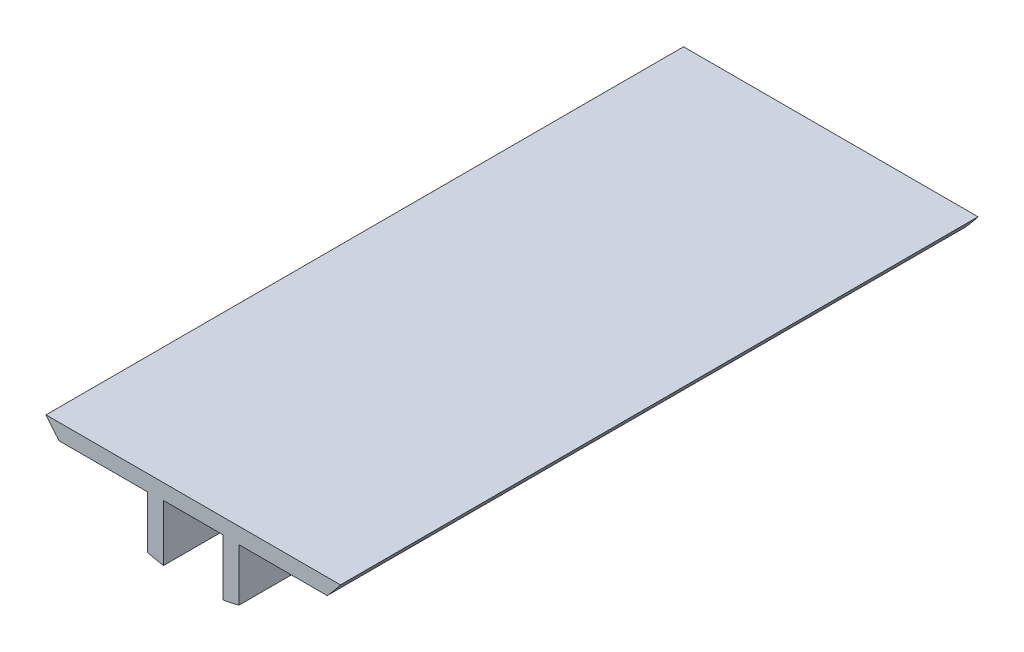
from build123d import *

# Parameters (mm, degrees)
BOSS_EXTRUDE1_DEPTH = 6000


with BuildPart() as part:
    # Sketch1 → Boss-Extrude1 (new body)
    with BuildSketch(Plane.XY):
        with BuildLine():
            Line((1385.578308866, -1025), (-1385.578308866, -1025))
            ThreePointArc((-1385.578308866, -1025), (-1325.354689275, -1101.765491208), (-1260.8835196, -1175))
            Line((-1260.8835196, -1175), (-429.805300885, -1175))
            Line((-429.805300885, -1175), (-429.805300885, -1669.047528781))
            ThreePointArc((-429.805300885, -1669.047528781), (-355.156658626, -1686.510005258), (-279.805300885, -1700.635541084))
            Line((-279.805300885, -1700.635541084), (-279.805300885, -1169.791384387))
            Line((-279.805300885, -1169.791384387), (279.805300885, -1169.791384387))
            Line((279.805300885, -1169.791384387), (279.805300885, -1700.635541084))
            ThreePointArc((279.805300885, -1700.635541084), (355.156658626, -1686.510005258), (429.805300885, -1669.047528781))
            Line((429.805300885, -1669.047528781), (429.805300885, -1175))
            Line((429.805300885, -1175), (1260.8835196, -1175))
            ThreePointArc((1260.8835196, -1175), (1325.354689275, -1101.765491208), (1385.578308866, -1025))
        make_face()
    extrude(amount=-BOSS_EXTRUDE1_DEPTH)


solid = part.part
